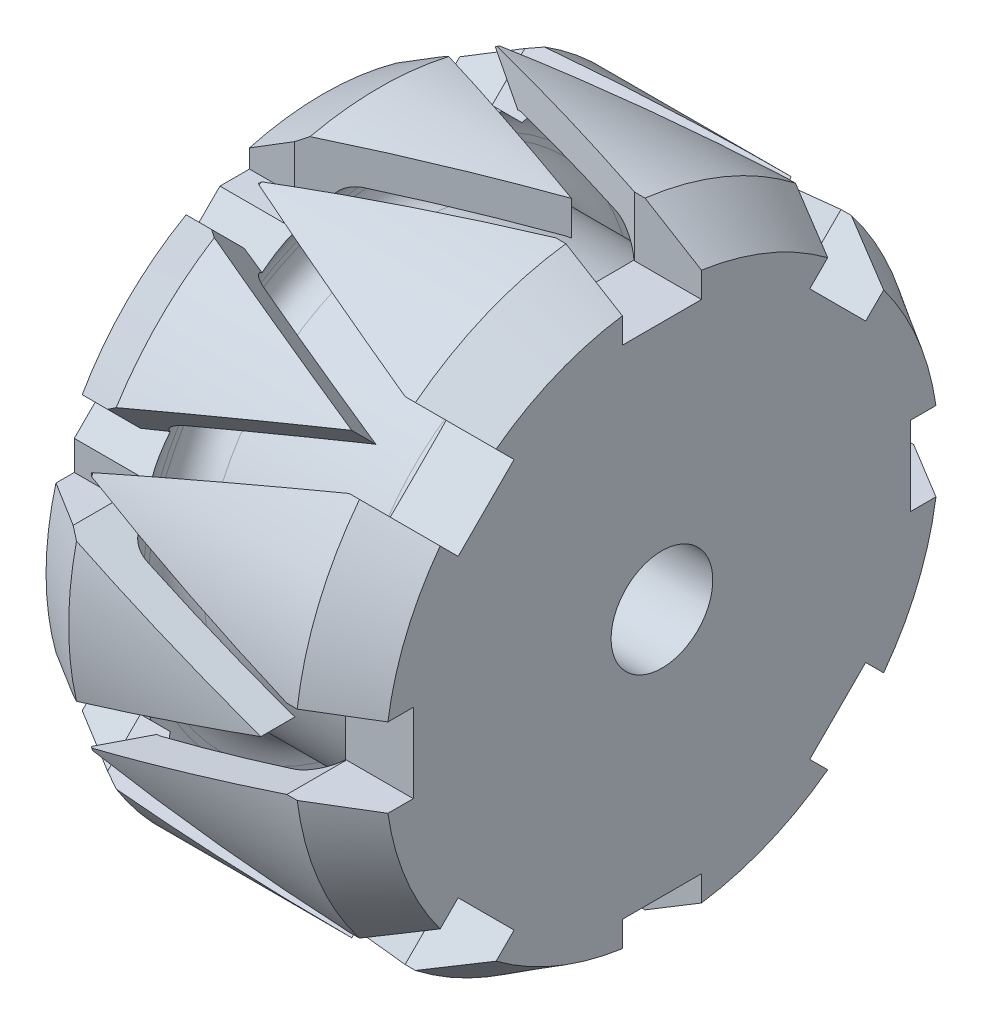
from build123d import *

# Parameters (mm, degrees)
ESQUISSE1_W                  = 60
ESQUISSE1_H                  = 46
CHANFREIN1_SIZE              = 10
CHANFREIN1_SIZE2             = 6
CHANFREIN2_SIZE              = 6
CHANFREIN2_SIZE2             = 10
ENL_V_MAT_EXTRU_1_DEPTH      = 16
ENL_V_MAT_EXTRU_2_DEPTH      = 16
R_P_TITION_CIRCULAIRE1_COUNT = 8


with BuildPart() as part:
    # Esquisse1 → Base-R_volution (revolve)
    with BuildSketch(Plane.XY, mode=Mode.PRIVATE) as base_r_volution_sk:
        with Locations((30, 32)):
            Rectangle(ESQUISSE1_W, ESQUISSE1_H)
    revolve(base_r_volution_sk.sketch.rotate(Axis((-34, 0, 0), (1, 0, 0)), 90), axis=Axis((-34, 0, 0), (1, 0, 0)))

    # Chanfrein1
    chanfrein1_edges = [part.edges().sort_by_distance(p)[0] for p in [
        (0, 0, -55),
    ]]
    chanfrein1_side = [part.faces().sort_by_distance(p)[0] for p in [
        (30, 0, -55),
    ]]
    chamfer(chanfrein1_edges, length=CHANFREIN1_SIZE, length2=CHANFREIN1_SIZE2, reference=chanfrein1_side[0])

    # Chanfrein2
    chanfrein2_edges = [part.edges().sort_by_distance(p)[0] for p in [
        (60, 0, -55),
    ]]
    chanfrein2_side = [part.faces().sort_by_distance(p)[0] for p in [
        (60, 0, -53.444365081),
    ]]
    chamfer(chanfrein2_edges, length=CHANFREIN2_SIZE, length2=CHANFREIN2_SIZE2, reference=chanfrein2_side[0])

    # Esquisse2 → Enl_v. mat.-Extru.1 (cut)
    with BuildSketch(Plane.XY.offset(60)):
        Polygon((8, 13), (-7.77247191, 13), (-6.288037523, 26.665195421), (48.169426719, 7), (69.121550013, 7), (69.121550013, 0), (84.605745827, -14.663185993), (44, 0), align=None)
    enl_v_mat_extru_1 = extrude(amount=-ENL_V_MAT_EXTRU_1_DEPTH, mode=Mode.SUBTRACT)

    # Esquisse3 → Enl_v. mat.-Extru.2 (cut)
    with BuildSketch(Plane.XY.offset(60)):
        Polygon((8, -13), (44, 0), (64.836886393, 7.524431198), (70.081819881, -7), (48.169426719, -7), (10.71715571, -20.524431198), (-12.672411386, -28.97066376), (-12.672411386, -13), align=None)
    enl_v_mat_extru_2 = extrude(amount=-ENL_V_MAT_EXTRU_2_DEPTH, mode=Mode.SUBTRACT)

    # R_p_tition circulaire1: Enl_v. mat.-Extru.1, Enl_v. mat.-Extru.2 ×8 about axis
    r_p_tition_circulaire1_axis = Axis((0, 0, 0), (1, 0, 0))
    add([enl_v_mat_extru_1.rotate(r_p_tition_circulaire1_axis, i * 360 / R_P_TITION_CIRCULAIRE1_COUNT) for i in range(1, R_P_TITION_CIRCULAIRE1_COUNT)], mode=Mode.SUBTRACT)
    add([enl_v_mat_extru_2.rotate(r_p_tition_circulaire1_axis, i * 360 / R_P_TITION_CIRCULAIRE1_COUNT) for i in range(1, R_P_TITION_CIRCULAIRE1_COUNT)], mode=Mode.SUBTRACT)

    # Esquisse4 → Enl_vement de mati_re-R_volution1 (revolve, cut)
    with BuildSketch(Plane.XY, mode=Mode.PRIVATE) as enl_vement_de_mati_re_r_volution1_sk:
        with BuildLine():
            Line((17, 49), (43, 49))
            ThreePointArc((43, 49), (46.535533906, 47.535533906), (48, 44))
            Line((48, 44), (48, 43))
            ThreePointArc((48, 43), (46.535533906, 39.464466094), (43, 38))
            Line((43, 38), (17, 38))
            ThreePointArc((17, 38), (13.464466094, 39.464466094), (12, 43))
            Line((12, 43), (12, 44))
            ThreePointArc((12, 44), (13.464466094, 47.535533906), (17, 49))
        make_face()
    revolve(enl_vement_de_mati_re_r_volution1_sk.sketch.rotate(Axis((0, 0, 0), (1, 0, 0)), 90), axis=Axis((0, 0, 0), (1, 0, 0)), mode=Mode.SUBTRACT)


solid = part.part
